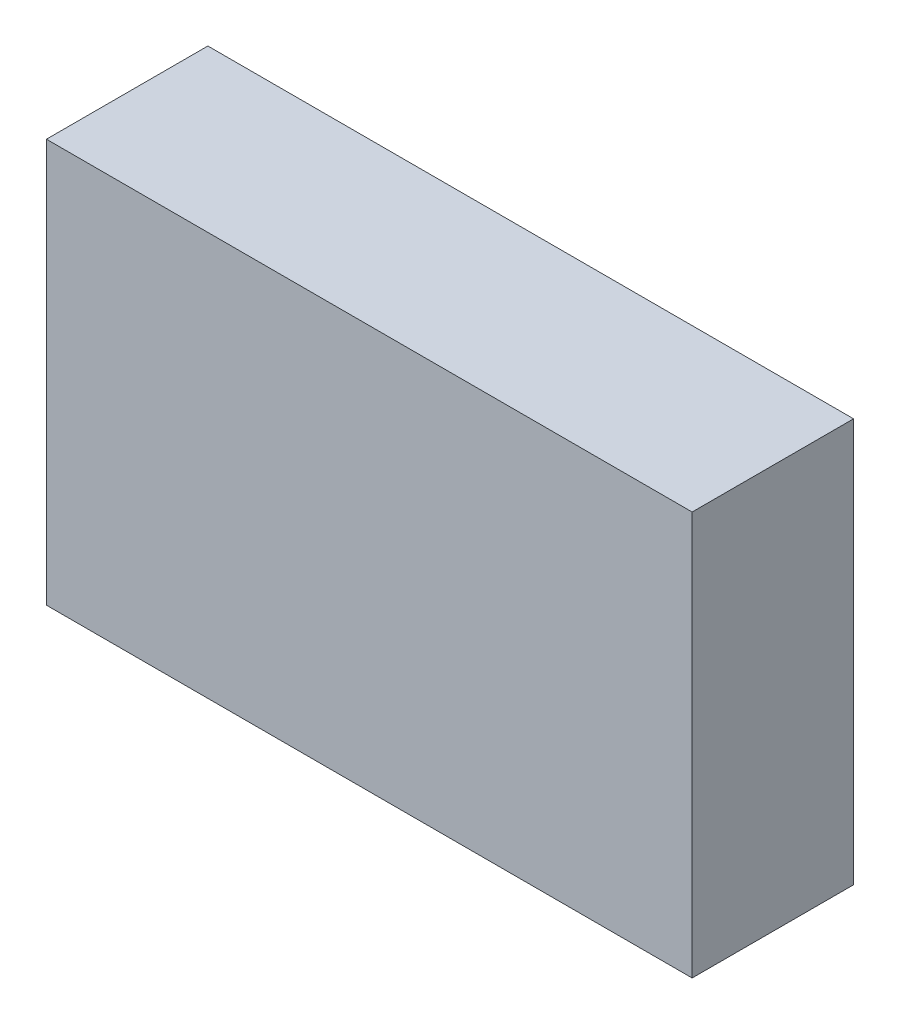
ISO-10303-21;
HEADER;
FILE_DESCRIPTION(('STEP AP214'),'2;1');
FILE_NAME('part.step','',(''),(''),'','','');
FILE_SCHEMA(('AUTOMOTIVE_DESIGN { 1 0 10303 214 1 1 1 1 }'));
ENDSEC;
DATA;
#1=APPLICATION_CONTEXT('core data for automotive mechanical design processes');
#2=APPLICATION_PROTOCOL_DEFINITION('international standard','automotive_design',2000,#1);
#3=PRODUCT_CONTEXT('',#1,'mechanical');
#4=PRODUCT('Part','Part','',(#3));
#5=PRODUCT_RELATED_PRODUCT_CATEGORY('part','',(#4));
#6=PRODUCT_DEFINITION_FORMATION('','',#4);
#7=PRODUCT_DEFINITION_CONTEXT('part definition',#1,'design');
#8=PRODUCT_DEFINITION('design','',#6,#7);
#9=PRODUCT_DEFINITION_SHAPE('','',#8);
#10=(LENGTH_UNIT() NAMED_UNIT(*) SI_UNIT(.MILLI.,.METRE.));
#11=(NAMED_UNIT(*) PLANE_ANGLE_UNIT() SI_UNIT($,.RADIAN.));
#12=(NAMED_UNIT(*) SI_UNIT($,.STERADIAN.) SOLID_ANGLE_UNIT());
#13=UNCERTAINTY_MEASURE_WITH_UNIT(LENGTH_MEASURE(1.E-05),#10,'distance_accuracy_value','');
#14=(GEOMETRIC_REPRESENTATION_CONTEXT(3) GLOBAL_UNCERTAINTY_ASSIGNED_CONTEXT((#13)) GLOBAL_UNIT_ASSIGNED_CONTEXT((#10,
#11,#12)) REPRESENTATION_CONTEXT('',''));
#15=CARTESIAN_POINT('',(0.,0.,0.));
#16=DIRECTION('',(0.,0.,1.));
#17=DIRECTION('',(1.,0.,0.));
#18=AXIS2_PLACEMENT_3D('',#15,#16,#17);
#19=CARTESIAN_POINT('',(0.,0.,25.4));
#20=DIRECTION('',(1.,0.,0.));
#21=DIRECTION('',(0.,0.,-1.));
#22=AXIS2_PLACEMENT_3D('',#19,#20,#21);
#23=PLANE('',#22);
#24=DIRECTION('',(0.,-1.,0.));
#25=VECTOR('',#24,1.);
#26=CARTESIAN_POINT('',(0.,0.,0.));
#27=LINE('',#26,#25);
#28=CARTESIAN_POINT('',(0.,63.5,0.));
#29=VERTEX_POINT('',#28);
#30=CARTESIAN_POINT('',(0.,0.,0.));
#31=VERTEX_POINT('',#30);
#32=EDGE_CURVE('E74',#29,#31,#27,.T.);
#33=ORIENTED_EDGE('',*,*,#32,.T.);
#34=DIRECTION('',(0.,0.,-1.));
#35=VECTOR('',#34,1.);
#36=CARTESIAN_POINT('',(0.,0.,25.4));
#37=LINE('',#36,#35);
#38=CARTESIAN_POINT('',(0.,0.,25.4));
#39=VERTEX_POINT('',#38);
#40=EDGE_CURVE('E11',#39,#31,#37,.T.);
#41=ORIENTED_EDGE('',*,*,#40,.F.);
#42=DIRECTION('',(0.,-1.,0.));
#43=VECTOR('',#42,1.);
#44=CARTESIAN_POINT('',(0.,0.,25.4));
#45=LINE('',#44,#43);
#46=CARTESIAN_POINT('',(0.,63.5,25.4));
#47=VERTEX_POINT('',#46);
#48=EDGE_CURVE('E92',#47,#39,#45,.T.);
#49=ORIENTED_EDGE('',*,*,#48,.F.);
#50=DIRECTION('',(0.,0.,-1.));
#51=VECTOR('',#50,1.);
#52=CARTESIAN_POINT('',(0.,63.5,25.4));
#53=LINE('',#52,#51);
#54=EDGE_CURVE('E86',#47,#29,#53,.T.);
#55=ORIENTED_EDGE('',*,*,#54,.T.);
#56=EDGE_LOOP('',(#33,#41,#49,#55));
#57=FACE_BOUND('',#56,.T.);
#58=ADVANCED_FACE('F30',(#57),#23,.F.);
#59=CARTESIAN_POINT('',(0.,0.,25.4));
#60=DIRECTION('',(0.,1.,0.));
#61=DIRECTION('',(0.,0.,1.));
#62=AXIS2_PLACEMENT_3D('',#59,#60,#61);
#63=PLANE('',#62);
#64=DIRECTION('',(1.,0.,0.));
#65=VECTOR('',#64,1.);
#66=CARTESIAN_POINT('',(0.,0.,0.));
#67=LINE('',#66,#65);
#68=CARTESIAN_POINT('',(101.6,0.,0.));
#69=VERTEX_POINT('',#68);
#70=EDGE_CURVE('E70',#31,#69,#67,.T.);
#71=ORIENTED_EDGE('',*,*,#70,.T.);
#72=DIRECTION('',(0.,0.,-1.));
#73=VECTOR('',#72,1.);
#74=CARTESIAN_POINT('',(101.6,0.,25.4));
#75=LINE('',#74,#73);
#76=CARTESIAN_POINT('',(101.6,0.,25.4));
#77=VERTEX_POINT('',#76);
#78=EDGE_CURVE('E37',#77,#69,#75,.T.);
#79=ORIENTED_EDGE('',*,*,#78,.F.);
#80=DIRECTION('',(1.,0.,0.));
#81=VECTOR('',#80,1.);
#82=CARTESIAN_POINT('',(0.,0.,25.4));
#83=LINE('',#82,#81);
#84=EDGE_CURVE('E82',#39,#77,#83,.T.);
#85=ORIENTED_EDGE('',*,*,#84,.F.);
#86=ORIENTED_EDGE('',*,*,#40,.T.);
#87=EDGE_LOOP('',(#71,#79,#85,#86));
#88=FACE_BOUND('',#87,.T.);
#89=ADVANCED_FACE('F81',(#88),#63,.F.);
#90=CARTESIAN_POINT('',(101.6,0.,25.4));
#91=DIRECTION('',(-1.,0.,0.));
#92=DIRECTION('',(0.,0.,1.));
#93=AXIS2_PLACEMENT_3D('',#90,#91,#92);
#94=PLANE('',#93);
#95=DIRECTION('',(0.,1.,0.));
#96=VECTOR('',#95,1.);
#97=CARTESIAN_POINT('',(101.6,0.,0.));
#98=LINE('',#97,#96);
#99=CARTESIAN_POINT('',(101.6,63.5,0.));
#100=VERTEX_POINT('',#99);
#101=EDGE_CURVE('E75',#69,#100,#98,.T.);
#102=ORIENTED_EDGE('',*,*,#101,.T.);
#103=DIRECTION('',(0.,0.,-1.));
#104=VECTOR('',#103,1.);
#105=CARTESIAN_POINT('',(101.6,63.5,25.4));
#106=LINE('',#105,#104);
#107=CARTESIAN_POINT('',(101.6,63.5,25.4));
#108=VERTEX_POINT('',#107);
#109=EDGE_CURVE('E98',#108,#100,#106,.T.);
#110=ORIENTED_EDGE('',*,*,#109,.F.);
#111=DIRECTION('',(0.,1.,0.));
#112=VECTOR('',#111,1.);
#113=CARTESIAN_POINT('',(101.6,0.,25.4));
#114=LINE('',#113,#112);
#115=EDGE_CURVE('E49',#77,#108,#114,.T.);
#116=ORIENTED_EDGE('',*,*,#115,.F.);
#117=ORIENTED_EDGE('',*,*,#78,.T.);
#118=EDGE_LOOP('',(#102,#110,#116,#117));
#119=FACE_BOUND('',#118,.T.);
#120=ADVANCED_FACE('F101',(#119),#94,.F.);
#121=CARTESIAN_POINT('',(0.,63.5,25.4));
#122=DIRECTION('',(0.,-1.,0.));
#123=DIRECTION('',(0.,0.,-1.));
#124=AXIS2_PLACEMENT_3D('',#121,#122,#123);
#125=PLANE('',#124);
#126=DIRECTION('',(-1.,0.,0.));
#127=VECTOR('',#126,1.);
#128=CARTESIAN_POINT('',(0.,63.5,0.));
#129=LINE('',#128,#127);
#130=EDGE_CURVE('E90',#100,#29,#129,.T.);
#131=ORIENTED_EDGE('',*,*,#130,.T.);
#132=ORIENTED_EDGE('',*,*,#54,.F.);
#133=DIRECTION('',(-1.,0.,0.));
#134=VECTOR('',#133,1.);
#135=CARTESIAN_POINT('',(0.,63.5,25.4));
#136=LINE('',#135,#134);
#137=EDGE_CURVE('E44',#108,#47,#136,.T.);
#138=ORIENTED_EDGE('',*,*,#137,.F.);
#139=ORIENTED_EDGE('',*,*,#109,.T.);
#140=EDGE_LOOP('',(#131,#132,#138,#139));
#141=FACE_BOUND('',#140,.T.);
#142=ADVANCED_FACE('F103',(#141),#125,.F.);
#143=CARTESIAN_POINT('',(0.,63.5,25.4));
#144=DIRECTION('',(0.,0.,-1.));
#145=DIRECTION('',(-1.,0.,0.));
#146=AXIS2_PLACEMENT_3D('',#143,#144,#145);
#147=PLANE('',#146);
#148=ORIENTED_EDGE('',*,*,#48,.T.);
#149=ORIENTED_EDGE('',*,*,#84,.T.);
#150=ORIENTED_EDGE('',*,*,#115,.T.);
#151=ORIENTED_EDGE('',*,*,#137,.T.);
#152=EDGE_LOOP('',(#148,#149,#150,#151));
#153=FACE_BOUND('',#152,.T.);
#154=ADVANCED_FACE('F104',(#153),#147,.F.);
#155=CARTESIAN_POINT('',(0.,63.5,0.));
#156=DIRECTION('',(0.,0.,-1.));
#157=DIRECTION('',(-1.,0.,0.));
#158=AXIS2_PLACEMENT_3D('',#155,#156,#157);
#159=PLANE('',#158);
#160=ORIENTED_EDGE('',*,*,#32,.F.);
#161=ORIENTED_EDGE('',*,*,#130,.F.);
#162=ORIENTED_EDGE('',*,*,#101,.F.);
#163=ORIENTED_EDGE('',*,*,#70,.F.);
#164=EDGE_LOOP('',(#160,#161,#162,#163));
#165=FACE_BOUND('',#164,.T.);
#166=ADVANCED_FACE('F71',(#165),#159,.T.);
#167=CLOSED_SHELL('',(#58,#89,#120,#142,#154,#166));
#168=MANIFOLD_SOLID_BREP('B2',#167);
#169=ADVANCED_BREP_SHAPE_REPRESENTATION('',(#18,#168),#14);
#170=SHAPE_DEFINITION_REPRESENTATION(#9,#169);
ENDSEC;
END-ISO-10303-21;
